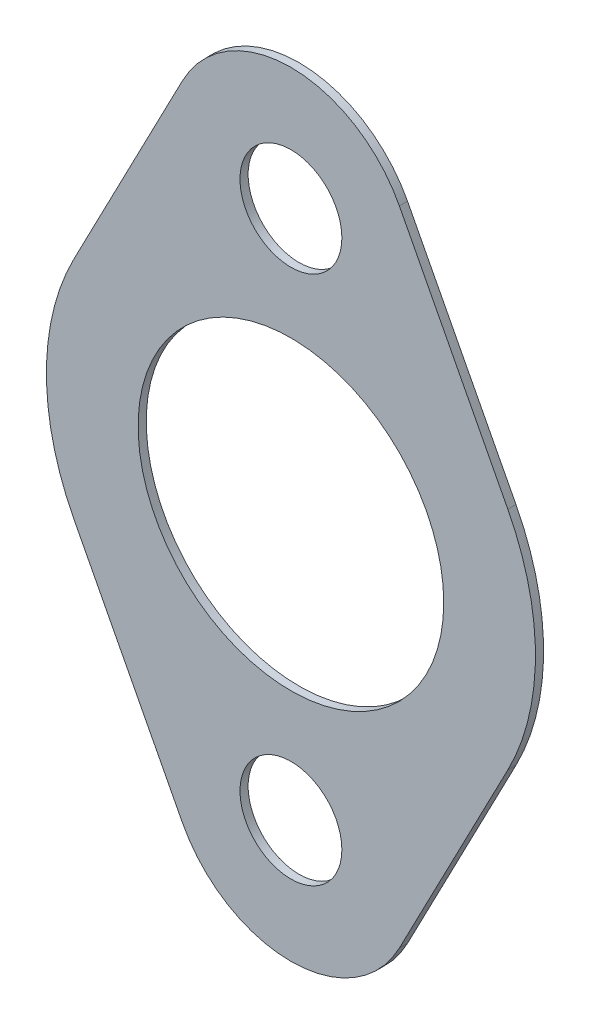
from build123d import *

# Parameters (mm, degrees)
MAIN_DEPTH  = 2
SKETCH2_R   = 12.5
SKETCH2_R_2 = 37.5
HOLES_DEPTH = 113.378823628


with BuildPart() as part:
    # Sketch1 → Main (new body)
    with BuildSketch(Plane.XY):
        with BuildLine():
            Line((26.613605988, 78.846153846), (53.227211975, 27.692307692))
            ThreePointArc((53.227211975, 27.692307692), (60, 0), (53.227211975, -27.692307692))
            Line((53.227211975, -27.692307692), (26.613605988, -78.846153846))
            ThreePointArc((26.613605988, -78.846153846), (0, -95), (-26.613605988, -78.846153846))
            Line((-26.613605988, -78.846153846), (-53.227211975, -27.692307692))
            ThreePointArc((-53.227211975, -27.692307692), (-60, 0), (-53.227211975, 27.692307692))
            Line((-53.227211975, 27.692307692), (-26.613605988, 78.846153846))
            ThreePointArc((-26.613605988, 78.846153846), (0, 95), (26.613605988, 78.846153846))
        make_face()
    extrude(amount=MAIN_DEPTH)

    # Sketch2 → Holes (cut, through all)
    with BuildSketch(Plane.XY.offset(2)):
        with Locations((0, 65)):
            Circle(SKETCH2_R)
        with Locations((0, -65)):
            Circle(SKETCH2_R)
        Circle(SKETCH2_R_2)
    extrude(amount=-HOLES_DEPTH, mode=Mode.SUBTRACT)


solid = part.part
